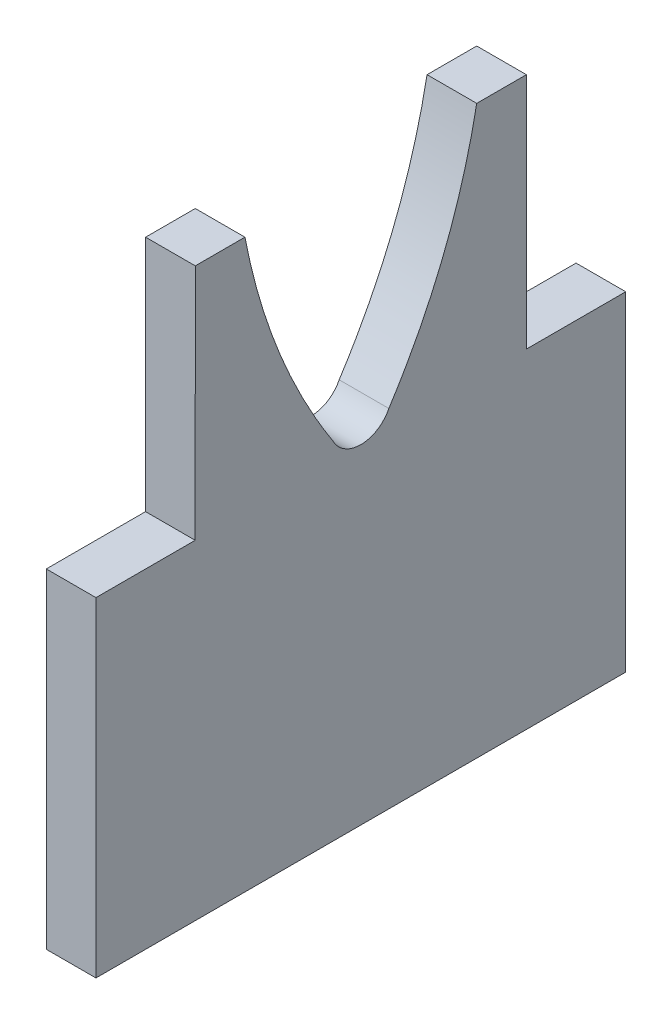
ISO-10303-21;
HEADER;
FILE_DESCRIPTION(('STEP AP214'),'2;1');
FILE_NAME('part.step','',(''),(''),'','','');
FILE_SCHEMA(('AUTOMOTIVE_DESIGN { 1 0 10303 214 1 1 1 1 }'));
ENDSEC;
DATA;
#1=APPLICATION_CONTEXT('core data for automotive mechanical design processes');
#2=APPLICATION_PROTOCOL_DEFINITION('international standard','automotive_design',2000,#1);
#3=PRODUCT_CONTEXT('',#1,'mechanical');
#4=PRODUCT('Part','Part','',(#3));
#5=PRODUCT_RELATED_PRODUCT_CATEGORY('part','',(#4));
#6=PRODUCT_DEFINITION_FORMATION('','',#4);
#7=PRODUCT_DEFINITION_CONTEXT('part definition',#1,'design');
#8=PRODUCT_DEFINITION('design','',#6,#7);
#9=PRODUCT_DEFINITION_SHAPE('','',#8);
#10=(LENGTH_UNIT() NAMED_UNIT(*) SI_UNIT(.MILLI.,.METRE.));
#11=(NAMED_UNIT(*) PLANE_ANGLE_UNIT() SI_UNIT($,.RADIAN.));
#12=(NAMED_UNIT(*) SI_UNIT($,.STERADIAN.) SOLID_ANGLE_UNIT());
#13=UNCERTAINTY_MEASURE_WITH_UNIT(LENGTH_MEASURE(1.E-05),#10,'distance_accuracy_value','');
#14=(GEOMETRIC_REPRESENTATION_CONTEXT(3) GLOBAL_UNCERTAINTY_ASSIGNED_CONTEXT((#13)) GLOBAL_UNIT_ASSIGNED_CONTEXT((#10,
#11,#12)) REPRESENTATION_CONTEXT('',''));
#15=CARTESIAN_POINT('',(0.,0.,0.));
#16=DIRECTION('',(0.,0.,1.));
#17=DIRECTION('',(1.,0.,0.));
#18=AXIS2_PLACEMENT_3D('',#15,#16,#17);
#19=CARTESIAN_POINT('',(196.778337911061,47.5294663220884,-32.));
#20=DIRECTION('',(0.,1.,0.));
#21=DIRECTION('',(0.,0.,1.));
#22=AXIS2_PLACEMENT_3D('',#19,#20,#21);
#23=PLANE('',#22);
#24=DIRECTION('',(0.,0.,1.));
#25=VECTOR('',#24,1.);
#26=CARTESIAN_POINT('',(196.778337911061,47.5294663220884,-32.));
#27=LINE('',#26,#25);
#28=CARTESIAN_POINT('',(196.778337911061,47.5294663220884,-32.));
#29=VERTEX_POINT('',#28);
#30=CARTESIAN_POINT('',(196.778337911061,47.5294663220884,-26.0037674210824));
#31=VERTEX_POINT('',#30);
#32=EDGE_CURVE('E11',#29,#31,#27,.T.);
#33=ORIENTED_EDGE('',*,*,#32,.T.);
#34=DIRECTION('',(-1.,0.,0.));
#35=VECTOR('',#34,1.);
#36=CARTESIAN_POINT('',(199.778337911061,47.5294663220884,-26.0037674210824));
#37=LINE('',#36,#35);
#38=CARTESIAN_POINT('',(199.778337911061,47.5294663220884,-26.0037674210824));
#39=VERTEX_POINT('',#38);
#40=EDGE_CURVE('E277',#39,#31,#37,.T.);
#41=ORIENTED_EDGE('',*,*,#40,.F.);
#42=DIRECTION('',(0.,0.,1.));
#43=VECTOR('',#42,1.);
#44=CARTESIAN_POINT('',(199.778337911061,47.5294663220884,-32.));
#45=LINE('',#44,#43);
#46=CARTESIAN_POINT('',(199.778337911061,47.5294663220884,-32.));
#47=VERTEX_POINT('',#46);
#48=EDGE_CURVE('E260',#47,#39,#45,.T.);
#49=ORIENTED_EDGE('',*,*,#48,.F.);
#50=DIRECTION('',(-1.,0.,0.));
#51=VECTOR('',#50,1.);
#52=CARTESIAN_POINT('',(196.778337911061,47.5294663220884,-32.));
#53=LINE('',#52,#51);
#54=EDGE_CURVE('E247',#47,#29,#53,.T.);
#55=ORIENTED_EDGE('',*,*,#54,.T.);
#56=EDGE_LOOP('',(#33,#41,#49,#55));
#57=FACE_BOUND('',#56,.T.);
#58=ADVANCED_FACE('F34',(#57),#23,.T.);
#59=DIRECTION('',(-1.,0.,0.));
#60=VECTOR('',#59,1.);
#61=CARTESIAN_POINT('',(199.778337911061,47.5294663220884,-5.9962325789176));
#62=LINE('',#61,#60);
#63=CARTESIAN_POINT('',(199.778337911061,47.5294663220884,-5.9962325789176));
#64=VERTEX_POINT('',#63);
#65=CARTESIAN_POINT('',(196.778337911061,47.5294663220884,-5.9962325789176));
#66=VERTEX_POINT('',#65);
#67=EDGE_CURVE('E234',#64,#66,#62,.T.);
#68=ORIENTED_EDGE('',*,*,#67,.T.);
#69=CARTESIAN_POINT('',(196.778337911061,47.5294663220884,0.));
#70=VERTEX_POINT('',#69);
#71=EDGE_CURVE('E43',#66,#70,#27,.T.);
#72=ORIENTED_EDGE('',*,*,#71,.T.);
#73=DIRECTION('',(-1.,0.,0.));
#74=VECTOR('',#73,1.);
#75=CARTESIAN_POINT('',(196.778337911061,47.5294663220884,0.));
#76=LINE('',#75,#74);
#77=CARTESIAN_POINT('',(199.778337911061,47.5294663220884,0.));
#78=VERTEX_POINT('',#77);
#79=EDGE_CURVE('E242',#78,#70,#76,.T.);
#80=ORIENTED_EDGE('',*,*,#79,.F.);
#81=EDGE_CURVE('E262',#64,#78,#45,.T.);
#82=ORIENTED_EDGE('',*,*,#81,.F.);
#83=EDGE_LOOP('',(#68,#72,#80,#82));
#84=FACE_BOUND('',#83,.T.);
#85=ADVANCED_FACE('F269',(#84),#23,.T.);
#86=CARTESIAN_POINT('',(196.778337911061,27.6308045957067,-32.));
#87=DIRECTION('',(-1.,0.,0.));
#88=DIRECTION('',(0.,0.,1.));
#89=AXIS2_PLACEMENT_3D('',#86,#87,#88);
#90=PLANE('',#89);
#91=DIRECTION('',(0.,-1.,0.));
#92=VECTOR('',#91,1.);
#93=CARTESIAN_POINT('',(196.778337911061,27.6308045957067,0.));
#94=LINE('',#93,#92);
#95=CARTESIAN_POINT('',(196.778337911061,27.6308045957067,0.));
#96=VERTEX_POINT('',#95);
#97=EDGE_CURVE('E233',#70,#96,#94,.T.);
#98=ORIENTED_EDGE('',*,*,#97,.F.);
#99=ORIENTED_EDGE('',*,*,#71,.F.);
#100=DIRECTION('',(0.,0.999999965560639,-0.000262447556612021));
#101=VECTOR('',#100,1.);
#102=CARTESIAN_POINT('',(196.778337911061,4.32000070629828,-5.98489235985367));
#103=LINE('',#102,#101);
#104=CARTESIAN_POINT('',(196.778337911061,61.884414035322,-5.99999999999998));
#105=VERTEX_POINT('',#104);
#106=EDGE_CURVE('E145',#66,#105,#103,.T.);
#107=ORIENTED_EDGE('',*,*,#106,.T.);
#108=DIRECTION('',(0.,0.,-1.));
#109=VECTOR('',#108,1.);
#110=CARTESIAN_POINT('',(196.778337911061,61.884414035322,-17.3779420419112));
#111=LINE('',#110,#109);
#112=CARTESIAN_POINT('',(196.778337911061,61.884414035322,-8.99999999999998));
#113=VERTEX_POINT('',#112);
#114=EDGE_CURVE('E176',#105,#113,#111,.T.);
#115=ORIENTED_EDGE('',*,*,#114,.T.);
#116=CARTESIAN_POINT('',(196.778337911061,61.884414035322,-8.99999999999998));
#117=CARTESIAN_POINT('',(196.778337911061,54.6712300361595,-10.3734508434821));
#118=CARTESIAN_POINT('',(196.778337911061,48.5779530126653,-14.3076831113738));
#119=B_SPLINE_CURVE_WITH_KNOTS('',2,(#116,#117,#118),.UNSPECIFIED.,.F.,.F.,(3,3),(0.,1.),.UNSPECIFIED.);
#120=CARTESIAN_POINT('',(196.778337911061,48.5779530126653,-14.3076831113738));
#121=VERTEX_POINT('',#120);
#122=EDGE_CURVE('E142',#113,#121,#119,.T.);
#123=ORIENTED_EDGE('',*,*,#122,.T.);
#124=CARTESIAN_POINT('',(196.778337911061,49.4194573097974,-16.));
#125=DIRECTION('',(-1.,0.,0.));
#126=DIRECTION('',(0.,0.,1.));
#127=AXIS2_PLACEMENT_3D('',#124,#125,#126);
#128=CIRCLE('',#127,1.88999098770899);
#129=CARTESIAN_POINT('',(196.778337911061,48.5779530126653,-17.6923168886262));
#130=VERTEX_POINT('',#129);
#131=EDGE_CURVE('E135',#130,#121,#128,.T.);
#132=ORIENTED_EDGE('',*,*,#131,.F.);
#133=CARTESIAN_POINT('',(196.778337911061,61.884414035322,-23.));
#134=CARTESIAN_POINT('',(196.778337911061,54.6712300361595,-21.6265491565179));
#135=CARTESIAN_POINT('',(196.778337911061,48.5779530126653,-17.6923168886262));
#136=B_SPLINE_CURVE_WITH_KNOTS('',2,(#133,#134,#135),.UNSPECIFIED.,.F.,.F.,(3,3),(0.,1.),.UNSPECIFIED.);
#137=CARTESIAN_POINT('',(196.778337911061,61.884414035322,-23.));
#138=VERTEX_POINT('',#137);
#139=EDGE_CURVE('E139',#138,#130,#136,.T.);
#140=ORIENTED_EDGE('',*,*,#139,.F.);
#141=DIRECTION('',(0.,0.,1.));
#142=VECTOR('',#141,1.);
#143=CARTESIAN_POINT('',(196.778337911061,61.884414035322,-17.3779420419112));
#144=LINE('',#143,#142);
#145=CARTESIAN_POINT('',(196.778337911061,61.884414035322,-26.));
#146=VERTEX_POINT('',#145);
#147=EDGE_CURVE('E166',#146,#138,#144,.T.);
#148=ORIENTED_EDGE('',*,*,#147,.F.);
#149=DIRECTION('',(0.,0.99999996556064,0.00026244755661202));
#150=VECTOR('',#149,1.);
#151=CARTESIAN_POINT('',(196.778337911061,4.31927743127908,-26.0151078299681));
#152=LINE('',#151,#150);
#153=EDGE_CURVE('E154',#31,#146,#152,.T.);
#154=ORIENTED_EDGE('',*,*,#153,.F.);
#155=ORIENTED_EDGE('',*,*,#32,.F.);
#156=DIRECTION('',(0.,-1.,0.));
#157=VECTOR('',#156,1.);
#158=CARTESIAN_POINT('',(196.778337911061,27.6308045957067,-32.));
#159=LINE('',#158,#157);
#160=CARTESIAN_POINT('',(196.778337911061,27.6308045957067,-32.));
#161=VERTEX_POINT('',#160);
#162=EDGE_CURVE('E239',#29,#161,#159,.T.);
#163=ORIENTED_EDGE('',*,*,#162,.T.);
#164=DIRECTION('',(0.,0.,1.));
#165=VECTOR('',#164,1.);
#166=CARTESIAN_POINT('',(196.778337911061,27.6308045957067,-32.));
#167=LINE('',#166,#165);
#168=EDGE_CURVE('E38',#161,#96,#167,.T.);
#169=ORIENTED_EDGE('',*,*,#168,.T.);
#170=EDGE_LOOP('',(#98,#99,#107,#115,#123,#132,#140,#148,#154,#155,#163,#169));
#171=FACE_BOUND('',#170,.T.);
#172=ADVANCED_FACE('F36',(#171),#90,.T.);
#173=CARTESIAN_POINT('',(199.778337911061,47.5294663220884,-32.));
#174=DIRECTION('',(1.,0.,0.));
#175=DIRECTION('',(0.,0.,-1.));
#176=AXIS2_PLACEMENT_3D('',#173,#174,#175);
#177=PLANE('',#176);
#178=DIRECTION('',(0.,1.,0.));
#179=VECTOR('',#178,1.);
#180=CARTESIAN_POINT('',(199.778337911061,47.5294663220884,0.));
#181=LINE('',#180,#179);
#182=CARTESIAN_POINT('',(199.778337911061,27.6308045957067,0.));
#183=VERTEX_POINT('',#182);
#184=EDGE_CURVE('E255',#183,#78,#181,.T.);
#185=ORIENTED_EDGE('',*,*,#184,.F.);
#186=DIRECTION('',(0.,0.,1.));
#187=VECTOR('',#186,1.);
#188=CARTESIAN_POINT('',(199.778337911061,27.6308045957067,-32.));
#189=LINE('',#188,#187);
#190=CARTESIAN_POINT('',(199.778337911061,27.6308045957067,-32.));
#191=VERTEX_POINT('',#190);
#192=EDGE_CURVE('E263',#191,#183,#189,.T.);
#193=ORIENTED_EDGE('',*,*,#192,.F.);
#194=DIRECTION('',(0.,1.,0.));
#195=VECTOR('',#194,1.);
#196=CARTESIAN_POINT('',(199.778337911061,47.5294663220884,-32.));
#197=LINE('',#196,#195);
#198=EDGE_CURVE('E244',#191,#47,#197,.T.);
#199=ORIENTED_EDGE('',*,*,#198,.T.);
#200=ORIENTED_EDGE('',*,*,#48,.T.);
#201=DIRECTION('',(0.,0.99999996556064,0.00026244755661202));
#202=VECTOR('',#201,1.);
#203=CARTESIAN_POINT('',(199.778337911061,4.31927743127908,-26.0151078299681));
#204=LINE('',#203,#202);
#205=CARTESIAN_POINT('',(199.778337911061,61.884414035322,-26.));
#206=VERTEX_POINT('',#205);
#207=EDGE_CURVE('E168',#39,#206,#204,.T.);
#208=ORIENTED_EDGE('',*,*,#207,.T.);
#209=DIRECTION('',(0.,0.,1.));
#210=VECTOR('',#209,1.);
#211=CARTESIAN_POINT('',(199.778337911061,61.884414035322,-17.3779420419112));
#212=LINE('',#211,#210);
#213=CARTESIAN_POINT('',(199.778337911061,61.884414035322,-23.));
#214=VERTEX_POINT('',#213);
#215=EDGE_CURVE('E173',#206,#214,#212,.T.);
#216=ORIENTED_EDGE('',*,*,#215,.T.);
#217=CARTESIAN_POINT('',(199.778337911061,61.884414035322,-23.));
#218=CARTESIAN_POINT('',(199.778337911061,54.6712300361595,-21.6265491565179));
#219=CARTESIAN_POINT('',(199.778337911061,48.5779530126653,-17.6923168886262));
#220=B_SPLINE_CURVE_WITH_KNOTS('',2,(#217,#218,#219),.UNSPECIFIED.,.F.,.F.,(3,3),(0.,1.),.UNSPECIFIED.);
#221=CARTESIAN_POINT('',(199.778337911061,48.5779530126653,-17.6923168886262));
#222=VERTEX_POINT('',#221);
#223=EDGE_CURVE('E174',#214,#222,#220,.T.);
#224=ORIENTED_EDGE('',*,*,#223,.T.);
#225=CARTESIAN_POINT('',(199.778337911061,49.4194573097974,-16.));
#226=DIRECTION('',(-1.,0.,0.));
#227=DIRECTION('',(0.,0.,1.));
#228=AXIS2_PLACEMENT_3D('',#225,#226,#227);
#229=CIRCLE('',#228,1.88999098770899);
#230=CARTESIAN_POINT('',(199.778337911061,48.5779530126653,-14.3076831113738));
#231=VERTEX_POINT('',#230);
#232=EDGE_CURVE('E150',#222,#231,#229,.T.);
#233=ORIENTED_EDGE('',*,*,#232,.T.);
#234=CARTESIAN_POINT('',(199.778337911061,61.884414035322,-8.99999999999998));
#235=CARTESIAN_POINT('',(199.778337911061,54.6712300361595,-10.3734508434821));
#236=CARTESIAN_POINT('',(199.778337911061,48.5779530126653,-14.3076831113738));
#237=B_SPLINE_CURVE_WITH_KNOTS('',2,(#234,#235,#236),.UNSPECIFIED.,.F.,.F.,(3,3),(0.,1.),.UNSPECIFIED.);
#238=CARTESIAN_POINT('',(199.778337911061,61.884414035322,-8.99999999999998));
#239=VERTEX_POINT('',#238);
#240=EDGE_CURVE('E210',#239,#231,#237,.T.);
#241=ORIENTED_EDGE('',*,*,#240,.F.);
#242=DIRECTION('',(0.,0.,-1.));
#243=VECTOR('',#242,1.);
#244=CARTESIAN_POINT('',(199.778337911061,61.884414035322,-17.3779420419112));
#245=LINE('',#244,#243);
#246=CARTESIAN_POINT('',(199.778337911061,61.884414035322,-5.99999999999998));
#247=VERTEX_POINT('',#246);
#248=EDGE_CURVE('E182',#247,#239,#245,.T.);
#249=ORIENTED_EDGE('',*,*,#248,.F.);
#250=DIRECTION('',(0.,0.999999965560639,-0.000262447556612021));
#251=VECTOR('',#250,1.);
#252=CARTESIAN_POINT('',(199.778337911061,4.32000070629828,-5.98489235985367));
#253=LINE('',#252,#251);
#254=EDGE_CURVE('E51',#64,#247,#253,.T.);
#255=ORIENTED_EDGE('',*,*,#254,.F.);
#256=ORIENTED_EDGE('',*,*,#81,.T.);
#257=EDGE_LOOP('',(#185,#193,#199,#200,#208,#216,#224,#233,#241,#249,#255,#256));
#258=FACE_BOUND('',#257,.T.);
#259=ADVANCED_FACE('F270',(#258),#177,.T.);
#260=CARTESIAN_POINT('',(199.778337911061,27.6308045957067,-32.));
#261=DIRECTION('',(0.,-1.,0.));
#262=DIRECTION('',(0.,0.,-1.));
#263=AXIS2_PLACEMENT_3D('',#260,#261,#262);
#264=PLANE('',#263);
#265=DIRECTION('',(1.,0.,0.));
#266=VECTOR('',#265,1.);
#267=CARTESIAN_POINT('',(199.778337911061,27.6308045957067,0.));
#268=LINE('',#267,#266);
#269=EDGE_CURVE('E252',#96,#183,#268,.T.);
#270=ORIENTED_EDGE('',*,*,#269,.F.);
#271=ORIENTED_EDGE('',*,*,#168,.F.);
#272=DIRECTION('',(1.,0.,0.));
#273=VECTOR('',#272,1.);
#274=CARTESIAN_POINT('',(199.778337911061,27.6308045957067,-32.));
#275=LINE('',#274,#273);
#276=EDGE_CURVE('E241',#161,#191,#275,.T.);
#277=ORIENTED_EDGE('',*,*,#276,.T.);
#278=ORIENTED_EDGE('',*,*,#192,.T.);
#279=EDGE_LOOP('',(#270,#271,#277,#278));
#280=FACE_BOUND('',#279,.T.);
#281=ADVANCED_FACE('F265',(#280),#264,.T.);
#282=CARTESIAN_POINT('',(196.778337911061,47.5294663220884,-32.));
#283=DIRECTION('',(0.,0.,-1.));
#284=DIRECTION('',(-1.,0.,0.));
#285=AXIS2_PLACEMENT_3D('',#282,#283,#284);
#286=PLANE('',#285);
#287=ORIENTED_EDGE('',*,*,#162,.F.);
#288=ORIENTED_EDGE('',*,*,#54,.F.);
#289=ORIENTED_EDGE('',*,*,#198,.F.);
#290=ORIENTED_EDGE('',*,*,#276,.F.);
#291=EDGE_LOOP('',(#287,#288,#289,#290));
#292=FACE_BOUND('',#291,.T.);
#293=ADVANCED_FACE('F274',(#292),#286,.T.);
#294=CARTESIAN_POINT('',(196.778337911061,47.5294663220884,0.));
#295=DIRECTION('',(0.,0.,-1.));
#296=DIRECTION('',(-1.,0.,0.));
#297=AXIS2_PLACEMENT_3D('',#294,#295,#296);
#298=PLANE('',#297);
#299=ORIENTED_EDGE('',*,*,#97,.T.);
#300=ORIENTED_EDGE('',*,*,#269,.T.);
#301=ORIENTED_EDGE('',*,*,#184,.T.);
#302=ORIENTED_EDGE('',*,*,#79,.T.);
#303=EDGE_LOOP('',(#299,#300,#301,#302));
#304=FACE_BOUND('',#303,.T.);
#305=ADVANCED_FACE('F267',(#304),#298,.F.);
#306=CARTESIAN_POINT('',(199.778337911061,61.884414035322,-17.3779420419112));
#307=DIRECTION('',(0.,1.,0.));
#308=DIRECTION('',(0.,0.,1.));
#309=AXIS2_PLACEMENT_3D('',#306,#307,#308);
#310=PLANE('',#309);
#311=ORIENTED_EDGE('',*,*,#114,.F.);
#312=DIRECTION('',(-1.,0.,0.));
#313=VECTOR('',#312,1.);
#314=CARTESIAN_POINT('',(199.778337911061,61.884414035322,-5.99999999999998));
#315=LINE('',#314,#313);
#316=EDGE_CURVE('E231',#247,#105,#315,.T.);
#317=ORIENTED_EDGE('',*,*,#316,.F.);
#318=ORIENTED_EDGE('',*,*,#248,.T.);
#319=DIRECTION('',(-1.,0.,0.));
#320=VECTOR('',#319,1.);
#321=CARTESIAN_POINT('',(199.778337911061,61.884414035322,-8.99999999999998));
#322=LINE('',#321,#320);
#323=EDGE_CURVE('E221',#239,#113,#322,.T.);
#324=ORIENTED_EDGE('',*,*,#323,.T.);
#325=EDGE_LOOP('',(#311,#317,#318,#324));
#326=FACE_BOUND('',#325,.T.);
#327=ADVANCED_FACE('F202',(#326),#310,.T.);
#328=CARTESIAN_POINT('',(199.778337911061,4.32000070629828,-5.98489235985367));
#329=DIRECTION('',(0.,0.000262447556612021,0.99999996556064));
#330=DIRECTION('',(0.,-0.99999996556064,0.000262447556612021));
#331=AXIS2_PLACEMENT_3D('',#328,#329,#330);
#332=PLANE('',#331);
#333=ORIENTED_EDGE('',*,*,#106,.F.);
#334=ORIENTED_EDGE('',*,*,#67,.F.);
#335=ORIENTED_EDGE('',*,*,#254,.T.);
#336=ORIENTED_EDGE('',*,*,#316,.T.);
#337=EDGE_LOOP('',(#333,#334,#335,#336));
#338=FACE_BOUND('',#337,.T.);
#339=ADVANCED_FACE('F199',(#338),#332,.T.);
#340=CARTESIAN_POINT('',(199.778337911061,49.4194573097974,-16.));
#341=DIRECTION('',(-1.,0.,0.));
#342=DIRECTION('',(0.,0.,1.));
#343=AXIS2_PLACEMENT_3D('',#340,#341,#342);
#344=CYLINDRICAL_SURFACE('',#343,1.88999098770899);
#345=ORIENTED_EDGE('',*,*,#131,.T.);
#346=DIRECTION('',(-1.,0.,0.));
#347=VECTOR('',#346,1.);
#348=CARTESIAN_POINT('',(199.778337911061,48.5779530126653,-14.3076831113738));
#349=LINE('',#348,#347);
#350=EDGE_CURVE('E236',#231,#121,#349,.T.);
#351=ORIENTED_EDGE('',*,*,#350,.F.);
#352=ORIENTED_EDGE('',*,*,#232,.F.);
#353=DIRECTION('',(-1.,0.,0.));
#354=VECTOR('',#353,1.);
#355=CARTESIAN_POINT('',(199.778337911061,48.5779530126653,-17.6923168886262));
#356=LINE('',#355,#354);
#357=EDGE_CURVE('E148',#222,#130,#356,.T.);
#358=ORIENTED_EDGE('',*,*,#357,.T.);
#359=EDGE_LOOP('',(#345,#351,#352,#358));
#360=FACE_BOUND('',#359,.T.);
#361=ADVANCED_FACE('F149',(#360),#344,.F.);
#362=DIRECTION('',(-1.,0.,0.));
#363=VECTOR('',#362,1.);
#364=SURFACE_OF_LINEAR_EXTRUSION('',#237,#363);
#365=ORIENTED_EDGE('',*,*,#122,.F.);
#366=ORIENTED_EDGE('',*,*,#323,.F.);
#367=ORIENTED_EDGE('',*,*,#240,.T.);
#368=ORIENTED_EDGE('',*,*,#350,.T.);
#369=EDGE_LOOP('',(#365,#366,#367,#368));
#370=FACE_BOUND('',#369,.T.);
#371=ADVANCED_FACE('F191',(#370),#364,.T.);
#372=DIRECTION('',(-1.,0.,0.));
#373=VECTOR('',#372,1.);
#374=SURFACE_OF_LINEAR_EXTRUSION('',#220,#373);
#375=ORIENTED_EDGE('',*,*,#139,.T.);
#376=ORIENTED_EDGE('',*,*,#357,.F.);
#377=ORIENTED_EDGE('',*,*,#223,.F.);
#378=DIRECTION('',(-1.,0.,0.));
#379=VECTOR('',#378,1.);
#380=CARTESIAN_POINT('',(199.778337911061,61.884414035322,-23.));
#381=LINE('',#380,#379);
#382=EDGE_CURVE('E155',#214,#138,#381,.T.);
#383=ORIENTED_EDGE('',*,*,#382,.T.);
#384=EDGE_LOOP('',(#375,#376,#377,#383));
#385=FACE_BOUND('',#384,.T.);
#386=ADVANCED_FACE('F158',(#385),#374,.F.);
#387=CARTESIAN_POINT('',(199.778337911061,4.31927743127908,-26.0151078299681));
#388=DIRECTION('',(0.,-0.00026244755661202,0.999999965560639));
#389=DIRECTION('',(0.,-0.999999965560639,-0.00026244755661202));
#390=AXIS2_PLACEMENT_3D('',#387,#388,#389);
#391=PLANE('',#390);
#392=ORIENTED_EDGE('',*,*,#153,.T.);
#393=DIRECTION('',(-1.,0.,0.));
#394=VECTOR('',#393,1.);
#395=CARTESIAN_POINT('',(199.778337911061,61.884414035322,-26.));
#396=LINE('',#395,#394);
#397=EDGE_CURVE('E181',#206,#146,#396,.T.);
#398=ORIENTED_EDGE('',*,*,#397,.F.);
#399=ORIENTED_EDGE('',*,*,#207,.F.);
#400=ORIENTED_EDGE('',*,*,#40,.T.);
#401=EDGE_LOOP('',(#392,#398,#399,#400));
#402=FACE_BOUND('',#401,.T.);
#403=ADVANCED_FACE('F190',(#402),#391,.F.);
#404=CARTESIAN_POINT('',(199.778337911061,61.884414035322,-17.3779420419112));
#405=DIRECTION('',(0.,-1.,0.));
#406=DIRECTION('',(0.,0.,-1.));
#407=AXIS2_PLACEMENT_3D('',#404,#405,#406);
#408=PLANE('',#407);
#409=ORIENTED_EDGE('',*,*,#147,.T.);
#410=ORIENTED_EDGE('',*,*,#382,.F.);
#411=ORIENTED_EDGE('',*,*,#215,.F.);
#412=ORIENTED_EDGE('',*,*,#397,.T.);
#413=EDGE_LOOP('',(#409,#410,#411,#412));
#414=FACE_BOUND('',#413,.T.);
#415=ADVANCED_FACE('F192',(#414),#408,.F.);
#416=CLOSED_SHELL('',(#58,#85,#172,#259,#281,#293,#305,#327,#339,#361,#371,#386,#403,#415));
#417=MANIFOLD_SOLID_BREP('B2',#416);
#418=ADVANCED_BREP_SHAPE_REPRESENTATION('',(#18,#417),#14);
#419=SHAPE_DEFINITION_REPRESENTATION(#9,#418);
ENDSEC;
END-ISO-10303-21;
